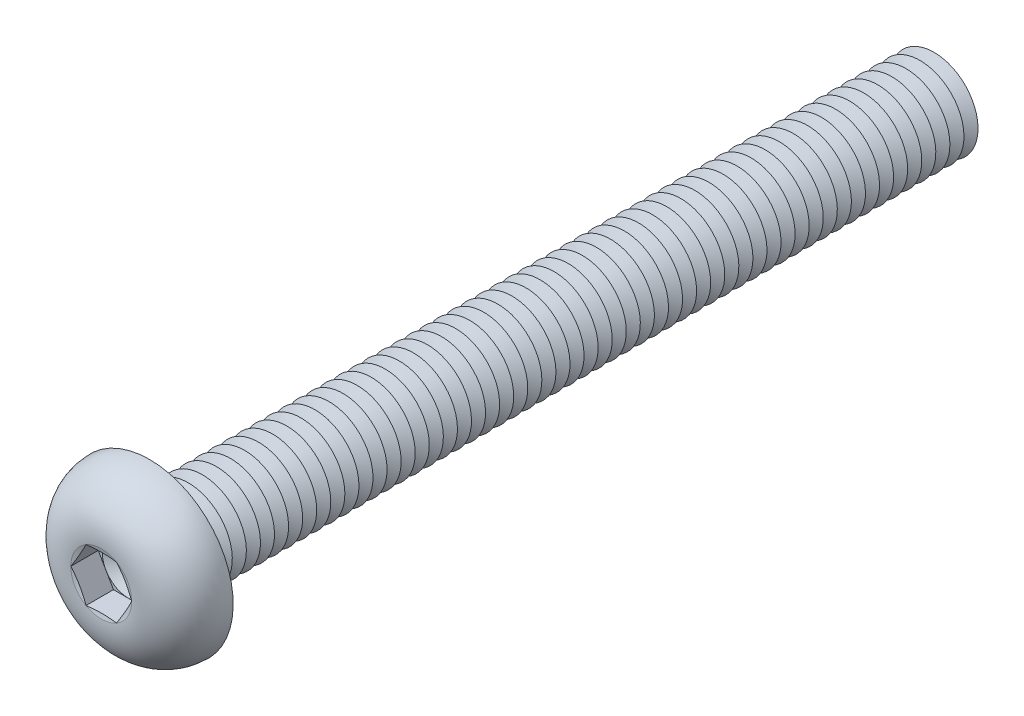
from build123d import *

# Parameters (mm, degrees)
FILLET1_R          = 0.4
LPATTERN1_COUNT    = 56
LPATTERN1_PITCH    = 0.8
CUT_EXTRUDE1_DEPTH = 1.56


with BuildPart() as part:
    # Sketch1 → Revolve1 (revolve)
    with BuildSketch(Plane(origin=(0, 0, 0), x_dir=(0, 0, -1), z_dir=(1, 0, 0))):
        with BuildLine():
            Line((0, 2.5), (0, 4.75))
            ThreePointArc((0, 4.75), (-2.041477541, 3.848329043), (-2.75, 1.73205))
            Line((-2.75, 1.73205), (-2.517949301, 0.866025))
            Line((-2.517949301, 0.866025), (-2.75, 0.866025))
            Line((-2.75, 0.866025), (-2.75, 0))
            Line((-2.75, 0), (45, 0))
            Line((45, 0), (45, 2.5))
            Line((45, 2.5), (0, 2.5))
        make_face()
    revolve(axis=Axis((0, 0, -45), (0, 0, 1)))

    # Fillet1
    fillet1_edges = [part.edges().sort_by_distance(p)[0] for p in [
        (0, -2.5, 0),
    ]]
    fillet(fillet1_edges, radius=FILLET1_R)

    # Sketch2 → Cut-Revolve1 (revolve, cut)
    with BuildSketch(Plane(origin=(0, 0, 0), x_dir=(0, 0, -1), z_dir=(1, 0, 0))):
        Polygon((44.6, 2.5), (45.4, 2.5), (45, 1.807179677), align=None)
    cut_revolve1 = revolve(axis=Axis((0, 0, -45), (0, 0, -1)), mode=Mode.SUBTRACT)

    # LPattern1: Cut-Revolve1 ×56
    with Locations(*[(0, 0, i * LPATTERN1_PITCH) for i in range(1, LPATTERN1_COUNT)]):
        add(cut_revolve1, mode=Mode.SUBTRACT)

    # Sketch3 → Cut-Extrude1 (cut)
    with BuildSketch(Plane.XY.offset(2.75)):
        Polygon((0.866025, 1.499999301), (-0.866025, 1.499999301), (-1.73205, 0), (-0.866025, -1.499999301), (0.866025, -1.499999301), (1.73205, 0), align=None)
    extrude(amount=-CUT_EXTRUDE1_DEPTH, mode=Mode.SUBTRACT)

    # Cut-Extrude2 cone 1 section (on through the dimple's axis) → Cut-Extrude2 (revolve, cut)
    with BuildSketch(Plane(origin=(0, 0, 1.19), x_dir=(0, -1, 0), z_dir=(1, 0, 0))):
        Polygon((0, 0), (1.499999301, 0), (0, 0.866025), align=None)
    revolve(axis=Axis((0, 0, 1.19), (0, 0, -1)), mode=Mode.SUBTRACT)


solid = part.part
